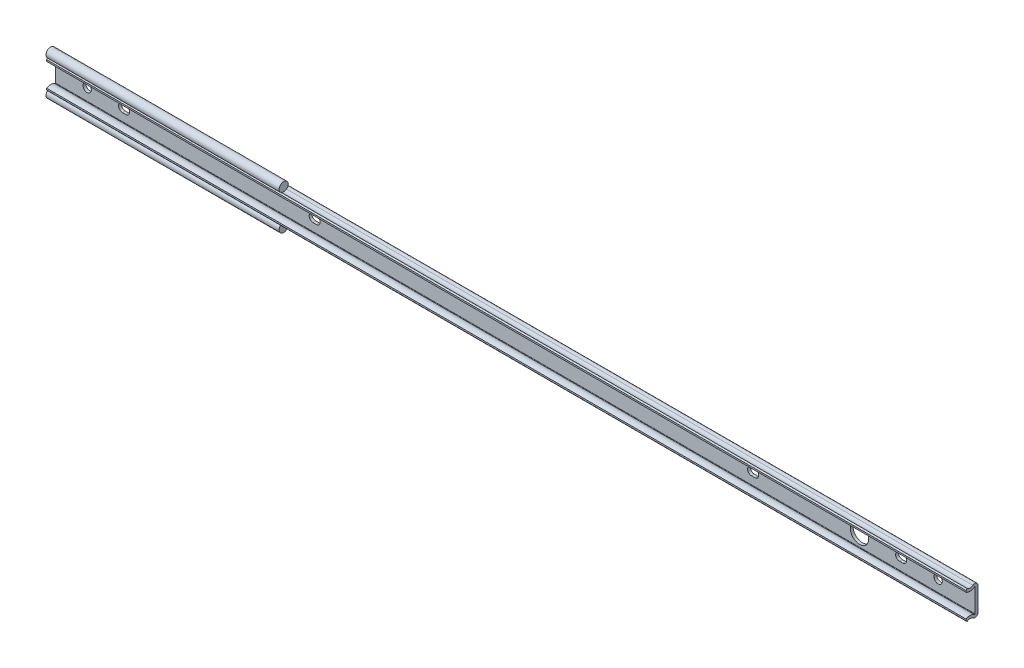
ISO-10303-21;
HEADER;
FILE_DESCRIPTION(('STEP AP214'),'2;1');
FILE_NAME('part.step','',(''),(''),'','','');
FILE_SCHEMA(('AUTOMOTIVE_DESIGN { 1 0 10303 214 1 1 1 1 }'));
ENDSEC;
DATA;
#1=APPLICATION_CONTEXT('core data for automotive mechanical design processes');
#2=APPLICATION_PROTOCOL_DEFINITION('international standard','automotive_design',2000,#1);
#3=PRODUCT_CONTEXT('',#1,'mechanical');
#4=PRODUCT('Part','Part','',(#3));
#5=PRODUCT_RELATED_PRODUCT_CATEGORY('part','',(#4));
#6=PRODUCT_DEFINITION_FORMATION('','',#4);
#7=PRODUCT_DEFINITION_CONTEXT('part definition',#1,'design');
#8=PRODUCT_DEFINITION('design','',#6,#7);
#9=PRODUCT_DEFINITION_SHAPE('','',#8);
#10=(LENGTH_UNIT() NAMED_UNIT(*) SI_UNIT(.MILLI.,.METRE.));
#11=(NAMED_UNIT(*) PLANE_ANGLE_UNIT() SI_UNIT($,.RADIAN.));
#12=(NAMED_UNIT(*) SI_UNIT($,.STERADIAN.) SOLID_ANGLE_UNIT());
#13=UNCERTAINTY_MEASURE_WITH_UNIT(LENGTH_MEASURE(1.E-05),#10,'distance_accuracy_value','');
#14=(GEOMETRIC_REPRESENTATION_CONTEXT(3) GLOBAL_UNCERTAINTY_ASSIGNED_CONTEXT((#13)) GLOBAL_UNIT_ASSIGNED_CONTEXT((#10,
#11,#12)) REPRESENTATION_CONTEXT('',''));
#15=CARTESIAN_POINT('',(0.,0.,0.));
#16=DIRECTION('',(0.,0.,1.));
#17=DIRECTION('',(1.,0.,0.));
#18=AXIS2_PLACEMENT_3D('',#15,#16,#17);
#19=CARTESIAN_POINT('',(-34.3563727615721,9.67006993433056,4.30999988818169));
#20=DIRECTION('',(1.,0.,0.));
#21=DIRECTION('',(0.,0.,-1.));
#22=AXIS2_PLACEMENT_3D('',#19,#20,#21);
#23=CYLINDRICAL_SURFACE('',#22,2.48);
#24=DIRECTION('',(1.,0.,0.));
#25=VECTOR('',#24,1.);
#26=CARTESIAN_POINT('',(-34.3563727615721,7.69580952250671,2.80910154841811));
#27=LINE('',#26,#25);
#28=CARTESIAN_POINT('',(109.,7.6958095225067,2.80910154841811));
#29=VERTEX_POINT('',#28);
#30=CARTESIAN_POINT('',(480.,7.6958095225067,2.80910154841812));
#31=VERTEX_POINT('',#30);
#32=EDGE_CURVE('E418',#29,#31,#27,.T.);
#33=ORIENTED_EDGE('',*,*,#32,.F.);
#34=CARTESIAN_POINT('',(109.,9.67006993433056,4.30999988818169));
#35=DIRECTION('',(-1.,0.,0.));
#36=DIRECTION('',(0.,0.,1.));
#37=AXIS2_PLACEMENT_3D('',#34,#35,#36);
#38=CIRCLE('',#37,2.48);
#39=CARTESIAN_POINT('',(109.,7.77027971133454,5.90411315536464));
#40=VERTEX_POINT('',#39);
#41=EDGE_CURVE('E272',#29,#40,#38,.T.);
#42=ORIENTED_EDGE('',*,*,#41,.T.);
#43=DIRECTION('',(1.,0.,0.));
#44=VECTOR('',#43,1.);
#45=CARTESIAN_POINT('',(-34.3563727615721,7.77027971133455,5.90411315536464));
#46=LINE('',#45,#44);
#47=CARTESIAN_POINT('',(480.,7.77027971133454,5.90411315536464));
#48=VERTEX_POINT('',#47);
#49=EDGE_CURVE('E416',#40,#48,#46,.T.);
#50=ORIENTED_EDGE('',*,*,#49,.T.);
#51=CARTESIAN_POINT('',(480.,9.67006993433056,4.30999988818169));
#52=DIRECTION('',(-1.,0.,0.));
#53=DIRECTION('',(0.,0.,1.));
#54=AXIS2_PLACEMENT_3D('',#51,#52,#53);
#55=CIRCLE('',#54,2.48);
#56=EDGE_CURVE('E391',#31,#48,#55,.T.);
#57=ORIENTED_EDGE('',*,*,#56,.F.);
#58=EDGE_LOOP('',(#33,#42,#50,#57));
#59=FACE_BOUND('',#58,.T.);
#60=ADVANCED_FACE('F14',(#59),#23,.F.);
#61=CARTESIAN_POINT('',(-34.3563727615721,6.30268270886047,1.74999971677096));
#62=DIRECTION('',(1.,0.,0.));
#63=DIRECTION('',(0.,0.,-1.));
#64=AXIS2_PLACEMENT_3D('',#61,#62,#63);
#65=CYLINDRICAL_SURFACE('',#64,0.199999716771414);
#66=CARTESIAN_POINT('',(-17.,6.30268270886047,1.74999971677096));
#67=DIRECTION('',(1.,0.,0.));
#68=DIRECTION('',(0.,0.,-1.));
#69=AXIS2_PLACEMENT_3D('',#66,#67,#68);
#70=CIRCLE('',#69,0.199999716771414);
#71=CARTESIAN_POINT('',(-17.,6.30268270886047,1.54999999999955));
#72=VERTEX_POINT('',#71);
#73=CARTESIAN_POINT('',(-17.,6.46189676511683,1.87104008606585));
#74=VERTEX_POINT('',#73);
#75=EDGE_CURVE('E382',#72,#74,#70,.T.);
#76=ORIENTED_EDGE('',*,*,#75,.F.);
#77=DIRECTION('',(1.,0.,0.));
#78=VECTOR('',#77,1.);
#79=CARTESIAN_POINT('',(-34.3563727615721,6.30268270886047,1.54999999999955));
#80=LINE('',#79,#78);
#81=CARTESIAN_POINT('',(480.,6.30268270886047,1.54999999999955));
#82=VERTEX_POINT('',#81);
#83=EDGE_CURVE('E369',#72,#82,#80,.T.);
#84=ORIENTED_EDGE('',*,*,#83,.T.);
#85=CARTESIAN_POINT('',(480.,6.30268270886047,1.74999971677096));
#86=DIRECTION('',(-1.,0.,0.));
#87=DIRECTION('',(0.,0.,1.));
#88=AXIS2_PLACEMENT_3D('',#85,#86,#87);
#89=CIRCLE('',#88,0.199999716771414);
#90=CARTESIAN_POINT('',(480.,6.46189676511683,1.87104008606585));
#91=VERTEX_POINT('',#90);
#92=EDGE_CURVE('E404',#91,#82,#89,.T.);
#93=ORIENTED_EDGE('',*,*,#92,.F.);
#94=DIRECTION('',(1.,0.,0.));
#95=VECTOR('',#94,1.);
#96=CARTESIAN_POINT('',(-34.3563727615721,6.46189676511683,1.87104008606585));
#97=LINE('',#96,#95);
#98=EDGE_CURVE('E410',#74,#91,#97,.T.);
#99=ORIENTED_EDGE('',*,*,#98,.F.);
#100=EDGE_LOOP('',(#76,#84,#93,#99));
#101=FACE_BOUND('',#100,.T.);
#102=ADVANCED_FACE('F567',(#101),#65,.F.);
#103=CARTESIAN_POINT('',(-34.3563727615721,9.67006993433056,4.30999988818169));
#104=DIRECTION('',(1.,0.,0.));
#105=DIRECTION('',(0.,0.,-1.));
#106=AXIS2_PLACEMENT_3D('',#103,#104,#105);
#107=CYLINDRICAL_SURFACE('',#106,4.03);
#108=CARTESIAN_POINT('',(-17.,9.67006993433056,4.30999988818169));
#109=DIRECTION('',(1.,0.,0.));
#110=DIRECTION('',(0.,0.,-1.));
#111=AXIS2_PLACEMENT_3D('',#108,#109,#110);
#112=CIRCLE('',#111,4.03);
#113=CARTESIAN_POINT('',(-17.,6.26782067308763,6.46999987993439));
#114=VERTEX_POINT('',#113);
#115=EDGE_CURVE('E380',#74,#114,#112,.F.);
#116=ORIENTED_EDGE('',*,*,#115,.F.);
#117=ORIENTED_EDGE('',*,*,#98,.T.);
#118=CARTESIAN_POINT('',(480.,9.67006993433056,4.30999988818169));
#119=DIRECTION('',(1.,0.,0.));
#120=DIRECTION('',(0.,0.,1.));
#121=AXIS2_PLACEMENT_3D('',#118,#119,#120);
#122=CIRCLE('',#121,4.03);
#123=CARTESIAN_POINT('',(480.,6.26782067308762,6.46999987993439));
#124=VERTEX_POINT('',#123);
#125=EDGE_CURVE('E401',#124,#91,#122,.T.);
#126=ORIENTED_EDGE('',*,*,#125,.F.);
#127=DIRECTION('',(1.,0.,0.));
#128=VECTOR('',#127,1.);
#129=CARTESIAN_POINT('',(-34.3563727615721,6.26782067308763,6.46999987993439));
#130=LINE('',#129,#128);
#131=EDGE_CURVE('E412',#114,#124,#130,.T.);
#132=ORIENTED_EDGE('',*,*,#131,.F.);
#133=EDGE_LOOP('',(#116,#117,#126,#132));
#134=FACE_BOUND('',#133,.T.);
#135=ADVANCED_FACE('F574',(#134),#107,.T.);
#136=CARTESIAN_POINT('',(-34.3563727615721,6.26782067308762,6.46999987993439));
#137=DIRECTION('',(0.,0.,1.));
#138=DIRECTION('',(1.,0.,0.));
#139=AXIS2_PLACEMENT_3D('',#136,#137,#138);
#140=PLANE('',#139);
#141=DIRECTION('',(0.,1.,0.));
#142=VECTOR('',#141,1.);
#143=CARTESIAN_POINT('',(-17.,6.26782067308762,6.46999987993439));
#144=LINE('',#143,#142);
#145=CARTESIAN_POINT('',(-17.,7.09588293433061,6.46999987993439));
#146=VERTEX_POINT('',#145);
#147=EDGE_CURVE('E378',#114,#146,#144,.T.);
#148=ORIENTED_EDGE('',*,*,#147,.F.);
#149=ORIENTED_EDGE('',*,*,#131,.T.);
#150=DIRECTION('',(0.,-1.,0.));
#151=VECTOR('',#150,1.);
#152=CARTESIAN_POINT('',(480.,6.26782067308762,6.46999987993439));
#153=LINE('',#152,#151);
#154=CARTESIAN_POINT('',(480.,7.09588293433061,6.46999987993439));
#155=VERTEX_POINT('',#154);
#156=EDGE_CURVE('E398',#155,#124,#153,.T.);
#157=ORIENTED_EDGE('',*,*,#156,.F.);
#158=DIRECTION('',(1.,0.,0.));
#159=VECTOR('',#158,1.);
#160=CARTESIAN_POINT('',(-34.3563727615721,7.09588293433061,6.46999987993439));
#161=LINE('',#160,#159);
#162=EDGE_CURVE('E414',#146,#155,#161,.T.);
#163=ORIENTED_EDGE('',*,*,#162,.F.);
#164=EDGE_LOOP('',(#148,#149,#157,#163));
#165=FACE_BOUND('',#164,.T.);
#166=ADVANCED_FACE('F579',(#165),#140,.T.);
#167=CARTESIAN_POINT('',(-34.3563727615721,7.09588293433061,6.46999987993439));
#168=DIRECTION('',(0.,0.642788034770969,0.766044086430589));
#169=DIRECTION('',(0.,-0.766044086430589,0.642788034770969));
#170=AXIS2_PLACEMENT_3D('',#167,#168,#169);
#171=PLANE('',#170);
#172=DIRECTION('',(-1.,0.,0.));
#173=VECTOR('',#172,1.);
#174=CARTESIAN_POINT('',(109.,7.6554298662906,6.00048372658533));
#175=LINE('',#174,#173);
#176=CARTESIAN_POINT('',(-17.,7.6554298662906,6.00048372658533));
#177=VERTEX_POINT('',#176);
#178=CARTESIAN_POINT('',(109.,7.6554298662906,6.00048372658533));
#179=VERTEX_POINT('',#178);
#180=EDGE_CURVE('E270',#177,#179,#175,.F.);
#181=ORIENTED_EDGE('',*,*,#180,.F.);
#182=DIRECTION('',(0.,0.766044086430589,-0.642788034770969));
#183=VECTOR('',#182,1.);
#184=CARTESIAN_POINT('',(-17.,7.09588293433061,6.46999987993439));
#185=LINE('',#184,#183);
#186=EDGE_CURVE('E376',#146,#177,#185,.T.);
#187=ORIENTED_EDGE('',*,*,#186,.F.);
#188=ORIENTED_EDGE('',*,*,#162,.T.);
#189=DIRECTION('',(0.,-0.766044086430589,0.642788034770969));
#190=VECTOR('',#189,1.);
#191=CARTESIAN_POINT('',(480.,7.09588293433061,6.46999987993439));
#192=LINE('',#191,#190);
#193=EDGE_CURVE('E395',#48,#155,#192,.T.);
#194=ORIENTED_EDGE('',*,*,#193,.F.);
#195=ORIENTED_EDGE('',*,*,#49,.F.);
#196=DIRECTION('',(0.,-0.766044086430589,0.642788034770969));
#197=VECTOR('',#196,1.);
#198=CARTESIAN_POINT('',(109.,7.09588293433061,6.46999987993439));
#199=LINE('',#198,#197);
#200=EDGE_CURVE('E275',#40,#179,#199,.T.);
#201=ORIENTED_EDGE('',*,*,#200,.T.);
#202=EDGE_LOOP('',(#181,#187,#188,#194,#195,#201));
#203=FACE_BOUND('',#202,.T.);
#204=ADVANCED_FACE('F582',(#203),#171,.T.);
#205=CARTESIAN_POINT('',(-34.3563727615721,6.30268270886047,1.74999971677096));
#206=DIRECTION('',(1.,0.,0.));
#207=DIRECTION('',(0.,0.,-1.));
#208=AXIS2_PLACEMENT_3D('',#205,#206,#207);
#209=CYLINDRICAL_SURFACE('',#208,1.74999971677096);
#210=DIRECTION('',(-1.,0.,0.));
#211=VECTOR('',#210,1.);
#212=CARTESIAN_POINT('',(46.,7.94505035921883,2.35425753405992));
#213=LINE('',#212,#211);
#214=CARTESIAN_POINT('',(109.,7.94505035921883,2.35425753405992));
#215=VERTEX_POINT('',#214);
#216=CARTESIAN_POINT('',(-17.,7.94505035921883,2.35425753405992));
#217=VERTEX_POINT('',#216);
#218=EDGE_CURVE('E267',#215,#217,#213,.T.);
#219=ORIENTED_EDGE('',*,*,#218,.F.);
#220=CARTESIAN_POINT('',(109.,6.30268270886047,1.74999971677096));
#221=DIRECTION('',(-1.,0.,0.));
#222=DIRECTION('',(0.,0.,1.));
#223=AXIS2_PLACEMENT_3D('',#220,#221,#222);
#224=CIRCLE('',#223,1.74999971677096);
#225=EDGE_CURVE('E22',#215,#29,#224,.F.);
#226=ORIENTED_EDGE('',*,*,#225,.T.);
#227=ORIENTED_EDGE('',*,*,#32,.T.);
#228=CARTESIAN_POINT('',(480.,6.30268270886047,1.74999971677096));
#229=DIRECTION('',(1.,0.,0.));
#230=DIRECTION('',(0.,0.,1.));
#231=AXIS2_PLACEMENT_3D('',#228,#229,#230);
#232=CIRCLE('',#231,1.74999971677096);
#233=CARTESIAN_POINT('',(480.,6.30268270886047,0.));
#234=VERTEX_POINT('',#233);
#235=EDGE_CURVE('E388',#234,#31,#232,.T.);
#236=ORIENTED_EDGE('',*,*,#235,.F.);
#237=DIRECTION('',(1.,0.,0.));
#238=VECTOR('',#237,1.);
#239=CARTESIAN_POINT('',(-34.3563727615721,6.30268270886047,0.));
#240=LINE('',#239,#238);
#241=CARTESIAN_POINT('',(-17.,6.30268270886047,0.));
#242=VERTEX_POINT('',#241);
#243=EDGE_CURVE('E407',#242,#234,#240,.T.);
#244=ORIENTED_EDGE('',*,*,#243,.F.);
#245=CARTESIAN_POINT('',(-17.,6.30268270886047,1.74999971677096));
#246=DIRECTION('',(1.,0.,0.));
#247=DIRECTION('',(0.,0.,-1.));
#248=AXIS2_PLACEMENT_3D('',#245,#246,#247);
#249=CIRCLE('',#248,1.74999971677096);
#250=EDGE_CURVE('E374',#217,#242,#249,.F.);
#251=ORIENTED_EDGE('',*,*,#250,.F.);
#252=EDGE_LOOP('',(#219,#226,#227,#236,#244,#251));
#253=FACE_BOUND('',#252,.T.);
#254=ADVANCED_FACE('F520',(#253),#209,.T.);
#255=CARTESIAN_POINT('',(480.,-6.30268270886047,1.74999971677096));
#256=DIRECTION('',(-1.,0.,0.));
#257=DIRECTION('',(0.,0.,1.));
#258=AXIS2_PLACEMENT_3D('',#255,#256,#257);
#259=CYLINDRICAL_SURFACE('',#258,1.74999971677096);
#260=CARTESIAN_POINT('',(109.,-6.30268270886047,1.74999971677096));
#261=DIRECTION('',(1.,0.,0.));
#262=DIRECTION('',(0.,0.,-1.));
#263=AXIS2_PLACEMENT_3D('',#260,#261,#262);
#264=CIRCLE('',#263,1.74999971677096);
#265=CARTESIAN_POINT('',(109.,-7.6958095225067,2.80910154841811));
#266=VERTEX_POINT('',#265);
#267=CARTESIAN_POINT('',(109.,-7.94505035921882,2.35425753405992));
#268=VERTEX_POINT('',#267);
#269=EDGE_CURVE('E245',#266,#268,#264,.T.);
#270=ORIENTED_EDGE('',*,*,#269,.T.);
#271=DIRECTION('',(-1.,0.,0.));
#272=VECTOR('',#271,1.);
#273=CARTESIAN_POINT('',(46.,-7.94505035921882,2.35425753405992));
#274=LINE('',#273,#272);
#275=CARTESIAN_POINT('',(-17.,-7.94505035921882,2.35425753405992));
#276=VERTEX_POINT('',#275);
#277=EDGE_CURVE('E246',#268,#276,#274,.T.);
#278=ORIENTED_EDGE('',*,*,#277,.T.);
#279=CARTESIAN_POINT('',(-17.,-6.30268270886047,1.74999971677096));
#280=DIRECTION('',(1.,0.,0.));
#281=DIRECTION('',(0.,0.,-1.));
#282=AXIS2_PLACEMENT_3D('',#279,#280,#281);
#283=CIRCLE('',#282,1.74999971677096);
#284=CARTESIAN_POINT('',(-17.,-6.30268270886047,0.));
#285=VERTEX_POINT('',#284);
#286=EDGE_CURVE('E371',#285,#276,#283,.F.);
#287=ORIENTED_EDGE('',*,*,#286,.F.);
#288=DIRECTION('',(-1.,0.,0.));
#289=VECTOR('',#288,1.);
#290=CARTESIAN_POINT('',(480.,-6.30268270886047,0.));
#291=LINE('',#290,#289);
#292=CARTESIAN_POINT('',(480.,-6.30268270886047,0.));
#293=VERTEX_POINT('',#292);
#294=EDGE_CURVE('E459',#293,#285,#291,.T.);
#295=ORIENTED_EDGE('',*,*,#294,.F.);
#296=CARTESIAN_POINT('',(480.,-6.30268270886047,1.74999971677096));
#297=DIRECTION('',(1.,0.,0.));
#298=DIRECTION('',(0.,0.,-1.));
#299=AXIS2_PLACEMENT_3D('',#296,#297,#298);
#300=CIRCLE('',#299,1.74999971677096);
#301=CARTESIAN_POINT('',(480.,-7.6958095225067,2.80910154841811));
#302=VERTEX_POINT('',#301);
#303=EDGE_CURVE('E429',#302,#293,#300,.T.);
#304=ORIENTED_EDGE('',*,*,#303,.F.);
#305=DIRECTION('',(-1.,0.,0.));
#306=VECTOR('',#305,1.);
#307=CARTESIAN_POINT('',(480.,-7.6958095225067,2.80910154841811));
#308=LINE('',#307,#306);
#309=EDGE_CURVE('E445',#302,#266,#308,.T.);
#310=ORIENTED_EDGE('',*,*,#309,.T.);
#311=EDGE_LOOP('',(#270,#278,#287,#295,#304,#310));
#312=FACE_BOUND('',#311,.T.);
#313=ADVANCED_FACE('F16',(#312),#259,.T.);
#314=CARTESIAN_POINT('',(480.,-6.30268270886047,0.));
#315=DIRECTION('',(0.,0.,1.));
#316=DIRECTION('',(0.,-1.,0.));
#317=AXIS2_PLACEMENT_3D('',#314,#315,#316);
#318=PLANE('',#317);
#319=CARTESIAN_POINT('',(460.,0.,0.));
#320=DIRECTION('',(0.,0.,-1.));
#321=DIRECTION('',(0.,1.,0.));
#322=AXIS2_PLACEMENT_3D('',#319,#320,#321);
#323=CIRCLE('',#322,2.24999999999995);
#324=CARTESIAN_POINT('',(460.,2.2499999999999,0.));
#325=VERTEX_POINT('',#324);
#326=EDGE_CURVE('E278',#325,#325,#323,.T.);
#327=ORIENTED_EDGE('',*,*,#326,.F.);
#328=EDGE_LOOP('',(#327));
#329=FACE_BOUND('',#328,.T.);
#330=DIRECTION('',(-1.,0.,0.));
#331=VECTOR('',#330,1.);
#332=CARTESIAN_POINT('',(20.9,-2.09999999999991,0.));
#333=LINE('',#332,#331);
#334=CARTESIAN_POINT('',(20.9,-2.09999999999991,0.));
#335=VERTEX_POINT('',#334);
#336=CARTESIAN_POINT('',(19.1,-2.09999999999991,0.));
#337=VERTEX_POINT('',#336);
#338=EDGE_CURVE('E306',#335,#337,#333,.T.);
#339=ORIENTED_EDGE('',*,*,#338,.F.);
#340=CARTESIAN_POINT('',(20.9,0.,0.));
#341=DIRECTION('',(0.,0.,-1.));
#342=DIRECTION('',(0.,1.,0.));
#343=AXIS2_PLACEMENT_3D('',#340,#341,#342);
#344=CIRCLE('',#343,2.1);
#345=CARTESIAN_POINT('',(20.9,2.10000000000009,0.));
#346=VERTEX_POINT('',#345);
#347=EDGE_CURVE('E37',#346,#335,#344,.T.);
#348=ORIENTED_EDGE('',*,*,#347,.F.);
#349=DIRECTION('',(1.,0.,0.));
#350=VECTOR('',#349,1.);
#351=CARTESIAN_POINT('',(20.9,2.10000000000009,0.));
#352=LINE('',#351,#350);
#353=CARTESIAN_POINT('',(19.1,2.10000000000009,0.));
#354=VERTEX_POINT('',#353);
#355=EDGE_CURVE('E312',#354,#346,#352,.T.);
#356=ORIENTED_EDGE('',*,*,#355,.F.);
#357=CARTESIAN_POINT('',(19.1,0.,0.));
#358=DIRECTION('',(0.,0.,-1.));
#359=DIRECTION('',(0.,1.,0.));
#360=AXIS2_PLACEMENT_3D('',#357,#358,#359);
#361=CIRCLE('',#360,2.1);
#362=EDGE_CURVE('E309',#337,#354,#361,.T.);
#363=ORIENTED_EDGE('',*,*,#362,.F.);
#364=EDGE_LOOP('',(#339,#348,#356,#363));
#365=FACE_BOUND('',#364,.T.);
#366=DIRECTION('',(-1.,0.,0.));
#367=VECTOR('',#366,1.);
#368=CARTESIAN_POINT('',(123.9,-2.09999999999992,0.));
#369=LINE('',#368,#367);
#370=CARTESIAN_POINT('',(123.9,-2.09999999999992,0.));
#371=VERTEX_POINT('',#370);
#372=CARTESIAN_POINT('',(122.1,-2.09999999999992,0.));
#373=VERTEX_POINT('',#372);
#374=EDGE_CURVE('E285',#371,#373,#369,.T.);
#375=ORIENTED_EDGE('',*,*,#374,.F.);
#376=CARTESIAN_POINT('',(123.9,0.,0.));
#377=DIRECTION('',(0.,0.,-1.));
#378=DIRECTION('',(0.,1.,0.));
#379=AXIS2_PLACEMENT_3D('',#376,#377,#378);
#380=CIRCLE('',#379,2.1);
#381=CARTESIAN_POINT('',(123.9,2.10000000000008,0.));
#382=VERTEX_POINT('',#381);
#383=EDGE_CURVE('E283',#382,#371,#380,.T.);
#384=ORIENTED_EDGE('',*,*,#383,.F.);
#385=DIRECTION('',(1.,0.,0.));
#386=VECTOR('',#385,1.);
#387=CARTESIAN_POINT('',(123.9,2.10000000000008,0.));
#388=LINE('',#387,#386);
#389=CARTESIAN_POINT('',(122.1,2.10000000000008,0.));
#390=VERTEX_POINT('',#389);
#391=EDGE_CURVE('E292',#390,#382,#388,.T.);
#392=ORIENTED_EDGE('',*,*,#391,.F.);
#393=CARTESIAN_POINT('',(122.1,0.,0.));
#394=DIRECTION('',(0.,0.,-1.));
#395=DIRECTION('',(0.,1.,0.));
#396=AXIS2_PLACEMENT_3D('',#393,#394,#395);
#397=CIRCLE('',#396,2.1);
#398=EDGE_CURVE('E289',#373,#390,#397,.T.);
#399=ORIENTED_EDGE('',*,*,#398,.F.);
#400=EDGE_LOOP('',(#375,#384,#392,#399));
#401=FACE_BOUND('',#400,.T.);
#402=CARTESIAN_POINT('',(0.,0.,0.));
#403=DIRECTION('',(0.,0.,-1.));
#404=DIRECTION('',(0.,1.,0.));
#405=AXIS2_PLACEMENT_3D('',#402,#403,#404);
#406=CIRCLE('',#405,2.24999999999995);
#407=CARTESIAN_POINT('',(0.,2.24999999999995,0.));
#408=VERTEX_POINT('',#407);
#409=EDGE_CURVE('E282',#408,#408,#406,.T.);
#410=ORIENTED_EDGE('',*,*,#409,.F.);
#411=EDGE_LOOP('',(#410));
#412=FACE_BOUND('',#411,.T.);
#413=CARTESIAN_POINT('',(417.5,0.,0.));
#414=DIRECTION('',(0.,0.,-1.));
#415=DIRECTION('',(0.,1.,0.));
#416=AXIS2_PLACEMENT_3D('',#413,#414,#415);
#417=CIRCLE('',#416,5.);
#418=CARTESIAN_POINT('',(417.5,4.99999999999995,0.));
#419=VERTEX_POINT('',#418);
#420=EDGE_CURVE('E337',#419,#419,#417,.T.);
#421=ORIENTED_EDGE('',*,*,#420,.F.);
#422=EDGE_LOOP('',(#421));
#423=FACE_BOUND('',#422,.T.);
#424=DIRECTION('',(-1.,0.,0.));
#425=VECTOR('',#424,1.);
#426=CARTESIAN_POINT('',(440.9,-2.10000000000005,0.));
#427=LINE('',#426,#425);
#428=CARTESIAN_POINT('',(440.9,-2.10000000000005,0.));
#429=VERTEX_POINT('',#428);
#430=CARTESIAN_POINT('',(439.1,-2.10000000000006,0.));
#431=VERTEX_POINT('',#430);
#432=EDGE_CURVE('E324',#429,#431,#427,.T.);
#433=ORIENTED_EDGE('',*,*,#432,.F.);
#434=CARTESIAN_POINT('',(440.9,0.,0.));
#435=DIRECTION('',(0.,0.,-1.));
#436=DIRECTION('',(0.,1.,0.));
#437=AXIS2_PLACEMENT_3D('',#434,#435,#436);
#438=CIRCLE('',#437,2.1);
#439=CARTESIAN_POINT('',(440.9,2.09999999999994,0.));
#440=VERTEX_POINT('',#439);
#441=EDGE_CURVE('E322',#440,#429,#438,.T.);
#442=ORIENTED_EDGE('',*,*,#441,.F.);
#443=DIRECTION('',(1.,0.,0.));
#444=VECTOR('',#443,1.);
#445=CARTESIAN_POINT('',(440.9,2.09999999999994,0.));
#446=LINE('',#445,#444);
#447=CARTESIAN_POINT('',(439.1,2.09999999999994,0.));
#448=VERTEX_POINT('',#447);
#449=EDGE_CURVE('E331',#448,#440,#446,.T.);
#450=ORIENTED_EDGE('',*,*,#449,.F.);
#451=CARTESIAN_POINT('',(439.1,0.,0.));
#452=DIRECTION('',(0.,0.,-1.));
#453=DIRECTION('',(0.,1.,0.));
#454=AXIS2_PLACEMENT_3D('',#451,#452,#453);
#455=CIRCLE('',#454,2.1);
#456=EDGE_CURVE('E328',#431,#448,#455,.T.);
#457=ORIENTED_EDGE('',*,*,#456,.F.);
#458=EDGE_LOOP('',(#433,#442,#450,#457));
#459=FACE_BOUND('',#458,.T.);
#460=DIRECTION('',(-1.,0.,0.));
#461=VECTOR('',#460,1.);
#462=CARTESIAN_POINT('',(360.9,-2.1,0.));
#463=LINE('',#462,#461);
#464=CARTESIAN_POINT('',(360.9,-2.1,0.));
#465=VERTEX_POINT('',#464);
#466=CARTESIAN_POINT('',(359.1,-2.1,0.));
#467=VERTEX_POINT('',#466);
#468=EDGE_CURVE('E345',#465,#467,#463,.T.);
#469=ORIENTED_EDGE('',*,*,#468,.F.);
#470=CARTESIAN_POINT('',(360.9,0.,0.));
#471=DIRECTION('',(0.,0.,-1.));
#472=DIRECTION('',(0.,1.,0.));
#473=AXIS2_PLACEMENT_3D('',#470,#471,#472);
#474=CIRCLE('',#473,2.1);
#475=CARTESIAN_POINT('',(360.9,2.1,0.));
#476=VERTEX_POINT('',#475);
#477=EDGE_CURVE('E298',#476,#465,#474,.T.);
#478=ORIENTED_EDGE('',*,*,#477,.F.);
#479=DIRECTION('',(1.,0.,0.));
#480=VECTOR('',#479,1.);
#481=CARTESIAN_POINT('',(360.9,2.1,0.));
#482=LINE('',#481,#480);
#483=CARTESIAN_POINT('',(359.1,2.1,0.));
#484=VERTEX_POINT('',#483);
#485=EDGE_CURVE('E351',#484,#476,#482,.T.);
#486=ORIENTED_EDGE('',*,*,#485,.F.);
#487=CARTESIAN_POINT('',(359.1,0.,0.));
#488=DIRECTION('',(0.,0.,-1.));
#489=DIRECTION('',(0.,1.,0.));
#490=AXIS2_PLACEMENT_3D('',#487,#488,#489);
#491=CIRCLE('',#490,2.1);
#492=EDGE_CURVE('E348',#467,#484,#491,.T.);
#493=ORIENTED_EDGE('',*,*,#492,.F.);
#494=EDGE_LOOP('',(#469,#478,#486,#493));
#495=FACE_BOUND('',#494,.T.);
#496=ORIENTED_EDGE('',*,*,#294,.T.);
#497=DIRECTION('',(0.,1.,0.));
#498=VECTOR('',#497,1.);
#499=CARTESIAN_POINT('',(-17.,-6.30268270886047,0.));
#500=LINE('',#499,#498);
#501=EDGE_CURVE('E424',#285,#242,#500,.T.);
#502=ORIENTED_EDGE('',*,*,#501,.T.);
#503=ORIENTED_EDGE('',*,*,#243,.T.);
#504=DIRECTION('',(0.,1.,0.));
#505=VECTOR('',#504,1.);
#506=CARTESIAN_POINT('',(480.,-6.30268270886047,0.));
#507=LINE('',#506,#505);
#508=EDGE_CURVE('E431',#293,#234,#507,.T.);
#509=ORIENTED_EDGE('',*,*,#508,.F.);
#510=EDGE_LOOP('',(#496,#502,#503,#509));
#511=FACE_BOUND('',#510,.T.);
#512=ADVANCED_FACE('F534',(#329,#365,#401,#412,#423,#459,#495,#511),#318,.F.);
#513=CARTESIAN_POINT('',(480.,-6.30268270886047,1.54999999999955));
#514=DIRECTION('',(0.,0.,-1.));
#515=DIRECTION('',(-1.,0.,0.));
#516=AXIS2_PLACEMENT_3D('',#513,#514,#515);
#517=PLANE('',#516);
#518=CARTESIAN_POINT('',(460.,0.,1.54999999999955));
#519=DIRECTION('',(0.,0.,-1.));
#520=DIRECTION('',(-1.,0.,0.));
#521=AXIS2_PLACEMENT_3D('',#518,#519,#520);
#522=CIRCLE('',#521,2.24999999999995);
#523=CARTESIAN_POINT('',(457.75,0.,1.54999999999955));
#524=VERTEX_POINT('',#523);
#525=EDGE_CURVE('E392',#524,#524,#522,.T.);
#526=ORIENTED_EDGE('',*,*,#525,.T.);
#527=EDGE_LOOP('',(#526));
#528=FACE_BOUND('',#527,.T.);
#529=DIRECTION('',(1.,0.,0.));
#530=VECTOR('',#529,1.);
#531=CARTESIAN_POINT('',(480.,2.1,1.54999999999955));
#532=LINE('',#531,#530);
#533=CARTESIAN_POINT('',(19.1,2.10000000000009,1.54999999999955));
#534=VERTEX_POINT('',#533);
#535=CARTESIAN_POINT('',(20.9,2.10000000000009,1.54999999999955));
#536=VERTEX_POINT('',#535);
#537=EDGE_CURVE('E509',#534,#536,#532,.T.);
#538=ORIENTED_EDGE('',*,*,#537,.T.);
#539=CARTESIAN_POINT('',(20.9,0.,1.54999999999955));
#540=DIRECTION('',(0.,0.,-1.));
#541=DIRECTION('',(-1.,0.,0.));
#542=AXIS2_PLACEMENT_3D('',#539,#540,#541);
#543=CIRCLE('',#542,2.1);
#544=CARTESIAN_POINT('',(20.9,-2.09999999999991,1.54999999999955));
#545=VERTEX_POINT('',#544);
#546=EDGE_CURVE('E512',#536,#545,#543,.T.);
#547=ORIENTED_EDGE('',*,*,#546,.T.);
#548=DIRECTION('',(-1.,0.,0.));
#549=VECTOR('',#548,1.);
#550=CARTESIAN_POINT('',(480.,-2.1,1.54999999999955));
#551=LINE('',#550,#549);
#552=CARTESIAN_POINT('',(19.1,-2.09999999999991,1.54999999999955));
#553=VERTEX_POINT('',#552);
#554=EDGE_CURVE('E503',#545,#553,#551,.T.);
#555=ORIENTED_EDGE('',*,*,#554,.T.);
#556=CARTESIAN_POINT('',(19.1,0.,1.54999999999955));
#557=DIRECTION('',(0.,0.,-1.));
#558=DIRECTION('',(-1.,0.,0.));
#559=AXIS2_PLACEMENT_3D('',#556,#557,#558);
#560=CIRCLE('',#559,2.1);
#561=EDGE_CURVE('E506',#553,#534,#560,.T.);
#562=ORIENTED_EDGE('',*,*,#561,.T.);
#563=EDGE_LOOP('',(#538,#547,#555,#562));
#564=FACE_BOUND('',#563,.T.);
#565=DIRECTION('',(1.,0.,0.));
#566=VECTOR('',#565,1.);
#567=CARTESIAN_POINT('',(480.,2.1,1.54999999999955));
#568=LINE('',#567,#566);
#569=CARTESIAN_POINT('',(122.1,2.10000000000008,1.54999999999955));
#570=VERTEX_POINT('',#569);
#571=CARTESIAN_POINT('',(123.9,2.10000000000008,1.54999999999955));
#572=VERTEX_POINT('',#571);
#573=EDGE_CURVE('E497',#570,#572,#568,.T.);
#574=ORIENTED_EDGE('',*,*,#573,.T.);
#575=CARTESIAN_POINT('',(123.9,0.,1.54999999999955));
#576=DIRECTION('',(0.,0.,-1.));
#577=DIRECTION('',(-1.,0.,0.));
#578=AXIS2_PLACEMENT_3D('',#575,#576,#577);
#579=CIRCLE('',#578,2.1);
#580=CARTESIAN_POINT('',(123.9,-2.09999999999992,1.54999999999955));
#581=VERTEX_POINT('',#580);
#582=EDGE_CURVE('E500',#572,#581,#579,.T.);
#583=ORIENTED_EDGE('',*,*,#582,.T.);
#584=DIRECTION('',(-1.,0.,0.));
#585=VECTOR('',#584,1.);
#586=CARTESIAN_POINT('',(480.,-2.1,1.54999999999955));
#587=LINE('',#586,#585);
#588=CARTESIAN_POINT('',(122.1,-2.09999999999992,1.54999999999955));
#589=VERTEX_POINT('',#588);
#590=EDGE_CURVE('E486',#581,#589,#587,.T.);
#591=ORIENTED_EDGE('',*,*,#590,.T.);
#592=CARTESIAN_POINT('',(122.1,0.,1.54999999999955));
#593=DIRECTION('',(0.,0.,-1.));
#594=DIRECTION('',(-1.,0.,0.));
#595=AXIS2_PLACEMENT_3D('',#592,#593,#594);
#596=CIRCLE('',#595,2.1);
#597=EDGE_CURVE('E494',#589,#570,#596,.T.);
#598=ORIENTED_EDGE('',*,*,#597,.T.);
#599=EDGE_LOOP('',(#574,#583,#591,#598));
#600=FACE_BOUND('',#599,.T.);
#601=CARTESIAN_POINT('',(0.,0.,1.54999999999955));
#602=DIRECTION('',(0.,0.,-1.));
#603=DIRECTION('',(-1.,0.,0.));
#604=AXIS2_PLACEMENT_3D('',#601,#602,#603);
#605=CIRCLE('',#604,2.24999999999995);
#606=CARTESIAN_POINT('',(-2.24999999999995,0.,1.54999999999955));
#607=VERTEX_POINT('',#606);
#608=EDGE_CURVE('E489',#607,#607,#605,.T.);
#609=ORIENTED_EDGE('',*,*,#608,.T.);
#610=EDGE_LOOP('',(#609));
#611=FACE_BOUND('',#610,.T.);
#612=CARTESIAN_POINT('',(417.5,0.,1.54999999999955));
#613=DIRECTION('',(0.,0.,-1.));
#614=DIRECTION('',(-1.,0.,0.));
#615=AXIS2_PLACEMENT_3D('',#612,#613,#614);
#616=CIRCLE('',#615,5.);
#617=CARTESIAN_POINT('',(412.5,0.,1.54999999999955));
#618=VERTEX_POINT('',#617);
#619=EDGE_CURVE('E281',#618,#618,#616,.T.);
#620=ORIENTED_EDGE('',*,*,#619,.T.);
#621=EDGE_LOOP('',(#620));
#622=FACE_BOUND('',#621,.T.);
#623=DIRECTION('',(1.,0.,0.));
#624=VECTOR('',#623,1.);
#625=CARTESIAN_POINT('',(480.,2.09999999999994,1.54999999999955));
#626=LINE('',#625,#624);
#627=CARTESIAN_POINT('',(439.1,2.09999999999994,1.54999999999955));
#628=VERTEX_POINT('',#627);
#629=CARTESIAN_POINT('',(440.9,2.09999999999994,1.54999999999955));
#630=VERTEX_POINT('',#629);
#631=EDGE_CURVE('E480',#628,#630,#626,.T.);
#632=ORIENTED_EDGE('',*,*,#631,.T.);
#633=CARTESIAN_POINT('',(440.9,0.,1.54999999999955));
#634=DIRECTION('',(0.,0.,-1.));
#635=DIRECTION('',(-1.,0.,0.));
#636=AXIS2_PLACEMENT_3D('',#633,#634,#635);
#637=CIRCLE('',#636,2.1);
#638=CARTESIAN_POINT('',(440.9,-2.10000000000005,1.54999999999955));
#639=VERTEX_POINT('',#638);
#640=EDGE_CURVE('E483',#630,#639,#637,.T.);
#641=ORIENTED_EDGE('',*,*,#640,.T.);
#642=DIRECTION('',(-1.,0.,0.));
#643=VECTOR('',#642,1.);
#644=CARTESIAN_POINT('',(480.,-2.10000000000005,1.54999999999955));
#645=LINE('',#644,#643);
#646=CARTESIAN_POINT('',(439.1,-2.10000000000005,1.54999999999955));
#647=VERTEX_POINT('',#646);
#648=EDGE_CURVE('E474',#639,#647,#645,.T.);
#649=ORIENTED_EDGE('',*,*,#648,.T.);
#650=CARTESIAN_POINT('',(439.1,0.,1.54999999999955));
#651=DIRECTION('',(0.,0.,-1.));
#652=DIRECTION('',(-1.,0.,0.));
#653=AXIS2_PLACEMENT_3D('',#650,#651,#652);
#654=CIRCLE('',#653,2.1);
#655=EDGE_CURVE('E477',#647,#628,#654,.T.);
#656=ORIENTED_EDGE('',*,*,#655,.T.);
#657=EDGE_LOOP('',(#632,#641,#649,#656));
#658=FACE_BOUND('',#657,.T.);
#659=DIRECTION('',(1.,0.,0.));
#660=VECTOR('',#659,1.);
#661=CARTESIAN_POINT('',(480.,2.09999999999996,1.54999999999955));
#662=LINE('',#661,#660);
#663=CARTESIAN_POINT('',(359.1,2.1,1.54999999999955));
#664=VERTEX_POINT('',#663);
#665=CARTESIAN_POINT('',(360.9,2.1,1.54999999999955));
#666=VERTEX_POINT('',#665);
#667=EDGE_CURVE('E468',#664,#666,#662,.T.);
#668=ORIENTED_EDGE('',*,*,#667,.T.);
#669=CARTESIAN_POINT('',(360.9,0.,1.54999999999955));
#670=DIRECTION('',(0.,0.,-1.));
#671=DIRECTION('',(-1.,0.,0.));
#672=AXIS2_PLACEMENT_3D('',#669,#670,#671);
#673=CIRCLE('',#672,2.1);
#674=CARTESIAN_POINT('',(360.9,-2.1,1.54999999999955));
#675=VERTEX_POINT('',#674);
#676=EDGE_CURVE('E471',#666,#675,#673,.T.);
#677=ORIENTED_EDGE('',*,*,#676,.T.);
#678=DIRECTION('',(-1.,0.,0.));
#679=VECTOR('',#678,1.);
#680=CARTESIAN_POINT('',(480.,-2.10000000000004,1.54999999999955));
#681=LINE('',#680,#679);
#682=CARTESIAN_POINT('',(359.1,-2.1,1.54999999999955));
#683=VERTEX_POINT('',#682);
#684=EDGE_CURVE('E462',#675,#683,#681,.T.);
#685=ORIENTED_EDGE('',*,*,#684,.T.);
#686=CARTESIAN_POINT('',(359.1,0.,1.54999999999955));
#687=DIRECTION('',(0.,0.,-1.));
#688=DIRECTION('',(-1.,0.,0.));
#689=AXIS2_PLACEMENT_3D('',#686,#687,#688);
#690=CIRCLE('',#689,2.1);
#691=EDGE_CURVE('E465',#683,#664,#690,.T.);
#692=ORIENTED_EDGE('',*,*,#691,.T.);
#693=EDGE_LOOP('',(#668,#677,#685,#692));
#694=FACE_BOUND('',#693,.T.);
#695=DIRECTION('',(0.,-1.,0.));
#696=VECTOR('',#695,1.);
#697=CARTESIAN_POINT('',(-17.,-6.30268270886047,1.54999999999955));
#698=LINE('',#697,#696);
#699=CARTESIAN_POINT('',(-17.,-6.30268270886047,1.54999999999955));
#700=VERTEX_POINT('',#699);
#701=EDGE_CURVE('E427',#72,#700,#698,.T.);
#702=ORIENTED_EDGE('',*,*,#701,.T.);
#703=DIRECTION('',(-1.,0.,0.));
#704=VECTOR('',#703,1.);
#705=CARTESIAN_POINT('',(480.,-6.30268270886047,1.54999999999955));
#706=LINE('',#705,#704);
#707=CARTESIAN_POINT('',(480.,-6.30268270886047,1.54999999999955));
#708=VERTEX_POINT('',#707);
#709=EDGE_CURVE('E456',#708,#700,#706,.T.);
#710=ORIENTED_EDGE('',*,*,#709,.F.);
#711=DIRECTION('',(0.,-1.,0.));
#712=VECTOR('',#711,1.);
#713=CARTESIAN_POINT('',(480.,-6.30268270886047,1.54999999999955));
#714=LINE('',#713,#712);
#715=EDGE_CURVE('E433',#82,#708,#714,.T.);
#716=ORIENTED_EDGE('',*,*,#715,.F.);
#717=ORIENTED_EDGE('',*,*,#83,.F.);
#718=EDGE_LOOP('',(#702,#710,#716,#717));
#719=FACE_BOUND('',#718,.T.);
#720=ADVANCED_FACE('F569',(#528,#564,#600,#611,#622,#658,#694,#719),#517,.F.);
#721=CARTESIAN_POINT('',(480.,-6.30268270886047,1.74999971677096));
#722=DIRECTION('',(-1.,0.,0.));
#723=DIRECTION('',(0.,0.,1.));
#724=AXIS2_PLACEMENT_3D('',#721,#722,#723);
#725=CYLINDRICAL_SURFACE('',#724,0.199999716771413);
#726=ORIENTED_EDGE('',*,*,#709,.T.);
#727=CARTESIAN_POINT('',(-17.,-6.30268270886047,1.74999971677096));
#728=DIRECTION('',(1.,0.,0.));
#729=DIRECTION('',(0.,0.,-1.));
#730=AXIS2_PLACEMENT_3D('',#727,#728,#729);
#731=CIRCLE('',#730,0.199999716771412);
#732=CARTESIAN_POINT('',(-17.,-6.46189676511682,1.87104008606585));
#733=VERTEX_POINT('',#732);
#734=EDGE_CURVE('E384',#733,#700,#731,.T.);
#735=ORIENTED_EDGE('',*,*,#734,.F.);
#736=DIRECTION('',(-1.,0.,0.));
#737=VECTOR('',#736,1.);
#738=CARTESIAN_POINT('',(480.,-6.46189676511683,1.87104008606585));
#739=LINE('',#738,#737);
#740=CARTESIAN_POINT('',(480.,-6.46189676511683,1.87104008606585));
#741=VERTEX_POINT('',#740);
#742=EDGE_CURVE('E454',#741,#733,#739,.T.);
#743=ORIENTED_EDGE('',*,*,#742,.F.);
#744=CARTESIAN_POINT('',(480.,-6.30268270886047,1.74999971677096));
#745=DIRECTION('',(-1.,0.,0.));
#746=DIRECTION('',(0.,0.,-1.));
#747=AXIS2_PLACEMENT_3D('',#744,#745,#746);
#748=CIRCLE('',#747,0.199999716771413);
#749=EDGE_CURVE('E435',#708,#741,#748,.T.);
#750=ORIENTED_EDGE('',*,*,#749,.F.);
#751=EDGE_LOOP('',(#726,#735,#743,#750));
#752=FACE_BOUND('',#751,.T.);
#753=ADVANCED_FACE('F559',(#752),#725,.F.);
#754=CARTESIAN_POINT('',(480.,-9.67006993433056,4.30999988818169));
#755=DIRECTION('',(-1.,0.,0.));
#756=DIRECTION('',(0.,0.,1.));
#757=AXIS2_PLACEMENT_3D('',#754,#755,#756);
#758=CYLINDRICAL_SURFACE('',#757,4.03);
#759=ORIENTED_EDGE('',*,*,#742,.T.);
#760=CARTESIAN_POINT('',(-17.,-9.67006993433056,4.30999988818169));
#761=DIRECTION('',(1.,0.,0.));
#762=DIRECTION('',(0.,0.,-1.));
#763=AXIS2_PLACEMENT_3D('',#760,#761,#762);
#764=CIRCLE('',#763,4.03);
#765=CARTESIAN_POINT('',(-17.,-6.26782067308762,6.46999987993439));
#766=VERTEX_POINT('',#765);
#767=EDGE_CURVE('E387',#766,#733,#764,.F.);
#768=ORIENTED_EDGE('',*,*,#767,.F.);
#769=DIRECTION('',(-1.,0.,0.));
#770=VECTOR('',#769,1.);
#771=CARTESIAN_POINT('',(480.,-6.26782067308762,6.46999987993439));
#772=LINE('',#771,#770);
#773=CARTESIAN_POINT('',(480.,-6.26782067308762,6.46999987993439));
#774=VERTEX_POINT('',#773);
#775=EDGE_CURVE('E452',#774,#766,#772,.T.);
#776=ORIENTED_EDGE('',*,*,#775,.F.);
#777=CARTESIAN_POINT('',(480.,-9.67006993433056,4.30999988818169));
#778=DIRECTION('',(1.,0.,0.));
#779=DIRECTION('',(0.,0.,-1.));
#780=AXIS2_PLACEMENT_3D('',#777,#778,#779);
#781=CIRCLE('',#780,4.03);
#782=EDGE_CURVE('E437',#741,#774,#781,.T.);
#783=ORIENTED_EDGE('',*,*,#782,.F.);
#784=EDGE_LOOP('',(#759,#768,#776,#783));
#785=FACE_BOUND('',#784,.T.);
#786=ADVANCED_FACE('F555',(#785),#758,.T.);
#787=CARTESIAN_POINT('',(480.,-6.26782067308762,6.46999987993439));
#788=DIRECTION('',(0.,0.,-1.));
#789=DIRECTION('',(-1.,0.,0.));
#790=AXIS2_PLACEMENT_3D('',#787,#788,#789);
#791=PLANE('',#790);
#792=ORIENTED_EDGE('',*,*,#775,.T.);
#793=DIRECTION('',(0.,1.,0.));
#794=VECTOR('',#793,1.);
#795=CARTESIAN_POINT('',(-17.,-6.26782067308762,6.46999987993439));
#796=LINE('',#795,#794);
#797=CARTESIAN_POINT('',(-17.,-7.09588293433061,6.46999987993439));
#798=VERTEX_POINT('',#797);
#799=EDGE_CURVE('E366',#798,#766,#796,.T.);
#800=ORIENTED_EDGE('',*,*,#799,.F.);
#801=DIRECTION('',(-1.,0.,0.));
#802=VECTOR('',#801,1.);
#803=CARTESIAN_POINT('',(480.,-7.09588293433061,6.46999987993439));
#804=LINE('',#803,#802);
#805=CARTESIAN_POINT('',(480.,-7.09588293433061,6.46999987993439));
#806=VERTEX_POINT('',#805);
#807=EDGE_CURVE('E450',#806,#798,#804,.T.);
#808=ORIENTED_EDGE('',*,*,#807,.F.);
#809=DIRECTION('',(0.,-1.,0.));
#810=VECTOR('',#809,1.);
#811=CARTESIAN_POINT('',(480.,-6.26782067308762,6.46999987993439));
#812=LINE('',#811,#810);
#813=EDGE_CURVE('E439',#774,#806,#812,.T.);
#814=ORIENTED_EDGE('',*,*,#813,.F.);
#815=EDGE_LOOP('',(#792,#800,#808,#814));
#816=FACE_BOUND('',#815,.T.);
#817=ADVANCED_FACE('F551',(#816),#791,.F.);
#818=CARTESIAN_POINT('',(480.,-7.77027971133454,5.90411315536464));
#819=DIRECTION('',(0.,0.642788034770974,-0.766044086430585));
#820=DIRECTION('',(0.,0.766044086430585,0.642788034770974));
#821=AXIS2_PLACEMENT_3D('',#818,#819,#820);
#822=PLANE('',#821);
#823=DIRECTION('',(0.,0.766044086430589,0.642788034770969));
#824=VECTOR('',#823,1.);
#825=CARTESIAN_POINT('',(-17.,-7.09588293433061,6.46999987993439));
#826=LINE('',#825,#824);
#827=CARTESIAN_POINT('',(-17.,-7.65542986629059,6.00048372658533));
#828=VERTEX_POINT('',#827);
#829=EDGE_CURVE('E258',#828,#798,#826,.T.);
#830=ORIENTED_EDGE('',*,*,#829,.F.);
#831=DIRECTION('',(-1.,0.,0.));
#832=VECTOR('',#831,1.);
#833=CARTESIAN_POINT('',(109.,-7.65542986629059,6.00048372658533));
#834=LINE('',#833,#832);
#835=CARTESIAN_POINT('',(109.,-7.65542986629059,6.00048372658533));
#836=VERTEX_POINT('',#835);
#837=EDGE_CURVE('E250',#828,#836,#834,.F.);
#838=ORIENTED_EDGE('',*,*,#837,.T.);
#839=DIRECTION('',(0.,-0.766044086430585,-0.642788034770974));
#840=VECTOR('',#839,1.);
#841=CARTESIAN_POINT('',(109.,-7.77027971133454,5.90411315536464));
#842=LINE('',#841,#840);
#843=CARTESIAN_POINT('',(109.,-7.77027971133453,5.90411315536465));
#844=VERTEX_POINT('',#843);
#845=EDGE_CURVE('E236',#836,#844,#842,.T.);
#846=ORIENTED_EDGE('',*,*,#845,.T.);
#847=DIRECTION('',(-1.,0.,0.));
#848=VECTOR('',#847,1.);
#849=CARTESIAN_POINT('',(480.,-7.77027971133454,5.90411315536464));
#850=LINE('',#849,#848);
#851=CARTESIAN_POINT('',(480.,-7.77027971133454,5.90411315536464));
#852=VERTEX_POINT('',#851);
#853=EDGE_CURVE('E448',#852,#844,#850,.T.);
#854=ORIENTED_EDGE('',*,*,#853,.F.);
#855=DIRECTION('',(0.,-0.766044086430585,-0.642788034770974));
#856=VECTOR('',#855,1.);
#857=CARTESIAN_POINT('',(480.,-7.77027971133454,5.90411315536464));
#858=LINE('',#857,#856);
#859=EDGE_CURVE('E441',#806,#852,#858,.T.);
#860=ORIENTED_EDGE('',*,*,#859,.F.);
#861=ORIENTED_EDGE('',*,*,#807,.T.);
#862=EDGE_LOOP('',(#830,#838,#846,#854,#860,#861));
#863=FACE_BOUND('',#862,.T.);
#864=ADVANCED_FACE('F256',(#863),#822,.F.);
#865=CARTESIAN_POINT('',(480.,-9.67006993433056,4.30999988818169));
#866=DIRECTION('',(-1.,0.,0.));
#867=DIRECTION('',(0.,0.,1.));
#868=AXIS2_PLACEMENT_3D('',#865,#866,#867);
#869=CYLINDRICAL_SURFACE('',#868,2.48);
#870=ORIENTED_EDGE('',*,*,#853,.T.);
#871=CARTESIAN_POINT('',(109.,-9.67006993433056,4.30999988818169));
#872=DIRECTION('',(1.,0.,0.));
#873=DIRECTION('',(0.,0.,-1.));
#874=AXIS2_PLACEMENT_3D('',#871,#872,#873);
#875=CIRCLE('',#874,2.48);
#876=EDGE_CURVE('E9',#844,#266,#875,.F.);
#877=ORIENTED_EDGE('',*,*,#876,.T.);
#878=ORIENTED_EDGE('',*,*,#309,.F.);
#879=CARTESIAN_POINT('',(480.,-9.67006993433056,4.30999988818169));
#880=DIRECTION('',(-1.,0.,0.));
#881=DIRECTION('',(0.,0.,-1.));
#882=AXIS2_PLACEMENT_3D('',#879,#880,#881);
#883=CIRCLE('',#882,2.48);
#884=EDGE_CURVE('E443',#852,#302,#883,.T.);
#885=ORIENTED_EDGE('',*,*,#884,.F.);
#886=EDGE_LOOP('',(#870,#877,#878,#885));
#887=FACE_BOUND('',#886,.T.);
#888=ADVANCED_FACE('F542',(#887),#869,.F.);
#889=CARTESIAN_POINT('',(480.,-6.30268270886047,1.74999971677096));
#890=DIRECTION('',(1.,0.,0.));
#891=DIRECTION('',(0.,0.,-1.));
#892=AXIS2_PLACEMENT_3D('',#889,#890,#891);
#893=PLANE('',#892);
#894=ORIENTED_EDGE('',*,*,#508,.T.);
#895=ORIENTED_EDGE('',*,*,#235,.T.);
#896=ORIENTED_EDGE('',*,*,#56,.T.);
#897=ORIENTED_EDGE('',*,*,#193,.T.);
#898=ORIENTED_EDGE('',*,*,#156,.T.);
#899=ORIENTED_EDGE('',*,*,#125,.T.);
#900=ORIENTED_EDGE('',*,*,#92,.T.);
#901=ORIENTED_EDGE('',*,*,#715,.T.);
#902=ORIENTED_EDGE('',*,*,#749,.T.);
#903=ORIENTED_EDGE('',*,*,#782,.T.);
#904=ORIENTED_EDGE('',*,*,#813,.T.);
#905=ORIENTED_EDGE('',*,*,#859,.T.);
#906=ORIENTED_EDGE('',*,*,#884,.T.);
#907=ORIENTED_EDGE('',*,*,#303,.T.);
#908=EDGE_LOOP('',(#894,#895,#896,#897,#898,#899,#900,#901,#902,#903,#904,#905,#906,#907));
#909=FACE_BOUND('',#908,.T.);
#910=ADVANCED_FACE('F530',(#909),#893,.T.);
#911=CARTESIAN_POINT('',(-17.,-6.30268270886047,1.74999971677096));
#912=DIRECTION('',(1.,0.,0.));
#913=DIRECTION('',(0.,0.,-1.));
#914=AXIS2_PLACEMENT_3D('',#911,#912,#913);
#915=PLANE('',#914);
#916=CARTESIAN_POINT('',(-17.,-9.47,4.31));
#917=DIRECTION('',(-1.,0.,0.));
#918=DIRECTION('',(0.,0.,-1.));
#919=AXIS2_PLACEMENT_3D('',#916,#917,#918);
#920=CIRCLE('',#919,2.48);
#921=EDGE_CURVE('E253',#276,#828,#920,.T.);
#922=ORIENTED_EDGE('',*,*,#921,.T.);
#923=ORIENTED_EDGE('',*,*,#829,.T.);
#924=ORIENTED_EDGE('',*,*,#799,.T.);
#925=ORIENTED_EDGE('',*,*,#767,.T.);
#926=ORIENTED_EDGE('',*,*,#734,.T.);
#927=ORIENTED_EDGE('',*,*,#701,.F.);
#928=ORIENTED_EDGE('',*,*,#75,.T.);
#929=ORIENTED_EDGE('',*,*,#115,.T.);
#930=ORIENTED_EDGE('',*,*,#147,.T.);
#931=ORIENTED_EDGE('',*,*,#186,.T.);
#932=CARTESIAN_POINT('',(-17.,9.47,4.31));
#933=DIRECTION('',(-1.,0.,0.));
#934=DIRECTION('',(0.,0.,1.));
#935=AXIS2_PLACEMENT_3D('',#932,#933,#934);
#936=CIRCLE('',#935,2.48);
#937=EDGE_CURVE('E29',#177,#217,#936,.T.);
#938=ORIENTED_EDGE('',*,*,#937,.T.);
#939=ORIENTED_EDGE('',*,*,#250,.T.);
#940=ORIENTED_EDGE('',*,*,#501,.F.);
#941=ORIENTED_EDGE('',*,*,#286,.T.);
#942=EDGE_LOOP('',(#922,#923,#924,#925,#926,#927,#928,#929,#930,#931,#938,#939,#940,#941));
#943=FACE_BOUND('',#942,.T.);
#944=ADVANCED_FACE('F537',(#943),#915,.F.);
#945=CARTESIAN_POINT('',(360.9,0.,10.));
#946=DIRECTION('',(0.,0.,-1.));
#947=DIRECTION('',(0.,1.,0.));
#948=AXIS2_PLACEMENT_3D('',#945,#946,#947);
#949=CYLINDRICAL_SURFACE('',#948,2.1);
#950=DIRECTION('',(0.,0.,-1.));
#951=VECTOR('',#950,1.);
#952=CARTESIAN_POINT('',(360.9,2.1,10.));
#953=LINE('',#952,#951);
#954=EDGE_CURVE('E325',#666,#476,#953,.T.);
#955=ORIENTED_EDGE('',*,*,#954,.T.);
#956=ORIENTED_EDGE('',*,*,#477,.T.);
#957=DIRECTION('',(0.,0.,-1.));
#958=VECTOR('',#957,1.);
#959=CARTESIAN_POINT('',(360.9,-2.1,10.));
#960=LINE('',#959,#958);
#961=EDGE_CURVE('E354',#675,#465,#960,.T.);
#962=ORIENTED_EDGE('',*,*,#961,.F.);
#963=ORIENTED_EDGE('',*,*,#676,.F.);
#964=EDGE_LOOP('',(#955,#956,#962,#963));
#965=FACE_BOUND('',#964,.T.);
#966=ADVANCED_FACE('F612',(#965),#949,.F.);
#967=CARTESIAN_POINT('',(360.9,2.1,10.));
#968=DIRECTION('',(0.,1.,0.));
#969=DIRECTION('',(1.,0.,0.));
#970=AXIS2_PLACEMENT_3D('',#967,#968,#969);
#971=PLANE('',#970);
#972=DIRECTION('',(0.,0.,-1.));
#973=VECTOR('',#972,1.);
#974=CARTESIAN_POINT('',(359.1,2.1,10.));
#975=LINE('',#974,#973);
#976=EDGE_CURVE('E356',#664,#484,#975,.T.);
#977=ORIENTED_EDGE('',*,*,#976,.T.);
#978=ORIENTED_EDGE('',*,*,#485,.T.);
#979=ORIENTED_EDGE('',*,*,#954,.F.);
#980=ORIENTED_EDGE('',*,*,#667,.F.);
#981=EDGE_LOOP('',(#977,#978,#979,#980));
#982=FACE_BOUND('',#981,.T.);
#983=ADVANCED_FACE('F663',(#982),#971,.F.);
#984=CARTESIAN_POINT('',(359.1,0.,10.));
#985=DIRECTION('',(0.,0.,-1.));
#986=DIRECTION('',(0.,1.,0.));
#987=AXIS2_PLACEMENT_3D('',#984,#985,#986);
#988=CYLINDRICAL_SURFACE('',#987,2.1);
#989=DIRECTION('',(0.,0.,-1.));
#990=VECTOR('',#989,1.);
#991=CARTESIAN_POINT('',(359.1,-2.1,10.));
#992=LINE('',#991,#990);
#993=EDGE_CURVE('E358',#683,#467,#992,.T.);
#994=ORIENTED_EDGE('',*,*,#993,.T.);
#995=ORIENTED_EDGE('',*,*,#492,.T.);
#996=ORIENTED_EDGE('',*,*,#976,.F.);
#997=ORIENTED_EDGE('',*,*,#691,.F.);
#998=EDGE_LOOP('',(#994,#995,#996,#997));
#999=FACE_BOUND('',#998,.T.);
#1000=ADVANCED_FACE('F665',(#999),#988,.F.);
#1001=CARTESIAN_POINT('',(360.9,-2.1,10.));
#1002=DIRECTION('',(0.,-1.,0.));
#1003=DIRECTION('',(-1.,0.,0.));
#1004=AXIS2_PLACEMENT_3D('',#1001,#1002,#1003);
#1005=PLANE('',#1004);
#1006=ORIENTED_EDGE('',*,*,#961,.T.);
#1007=ORIENTED_EDGE('',*,*,#468,.T.);
#1008=ORIENTED_EDGE('',*,*,#993,.F.);
#1009=ORIENTED_EDGE('',*,*,#684,.F.);
#1010=EDGE_LOOP('',(#1006,#1007,#1008,#1009));
#1011=FACE_BOUND('',#1010,.T.);
#1012=ADVANCED_FACE('F655',(#1011),#1005,.F.);
#1013=CARTESIAN_POINT('',(440.9,0.,10.));
#1014=DIRECTION('',(0.,0.,-1.));
#1015=DIRECTION('',(0.,1.,0.));
#1016=AXIS2_PLACEMENT_3D('',#1013,#1014,#1015);
#1017=CYLINDRICAL_SURFACE('',#1016,2.1);
#1018=DIRECTION('',(0.,0.,-1.));
#1019=VECTOR('',#1018,1.);
#1020=CARTESIAN_POINT('',(440.9,2.09999999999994,10.));
#1021=LINE('',#1020,#1019);
#1022=EDGE_CURVE('E335',#630,#440,#1021,.T.);
#1023=ORIENTED_EDGE('',*,*,#1022,.T.);
#1024=ORIENTED_EDGE('',*,*,#441,.T.);
#1025=DIRECTION('',(0.,0.,-1.));
#1026=VECTOR('',#1025,1.);
#1027=CARTESIAN_POINT('',(440.9,-2.10000000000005,10.));
#1028=LINE('',#1027,#1026);
#1029=EDGE_CURVE('E334',#639,#429,#1028,.T.);
#1030=ORIENTED_EDGE('',*,*,#1029,.F.);
#1031=ORIENTED_EDGE('',*,*,#640,.F.);
#1032=EDGE_LOOP('',(#1023,#1024,#1030,#1031));
#1033=FACE_BOUND('',#1032,.T.);
#1034=ADVANCED_FACE('F673',(#1033),#1017,.F.);
#1035=CARTESIAN_POINT('',(440.9,2.09999999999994,10.));
#1036=DIRECTION('',(0.,1.,0.));
#1037=DIRECTION('',(0.,0.,1.));
#1038=AXIS2_PLACEMENT_3D('',#1035,#1036,#1037);
#1039=PLANE('',#1038);
#1040=DIRECTION('',(0.,0.,-1.));
#1041=VECTOR('',#1040,1.);
#1042=CARTESIAN_POINT('',(439.1,2.09999999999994,10.));
#1043=LINE('',#1042,#1041);
#1044=EDGE_CURVE('E338',#628,#448,#1043,.T.);
#1045=ORIENTED_EDGE('',*,*,#1044,.T.);
#1046=ORIENTED_EDGE('',*,*,#449,.T.);
#1047=ORIENTED_EDGE('',*,*,#1022,.F.);
#1048=ORIENTED_EDGE('',*,*,#631,.F.);
#1049=EDGE_LOOP('',(#1045,#1046,#1047,#1048));
#1050=FACE_BOUND('',#1049,.T.);
#1051=ADVANCED_FACE('F904',(#1050),#1039,.F.);
#1052=CARTESIAN_POINT('',(439.1,0.,10.));
#1053=DIRECTION('',(0.,0.,-1.));
#1054=DIRECTION('',(0.,1.,0.));
#1055=AXIS2_PLACEMENT_3D('',#1052,#1053,#1054);
#1056=CYLINDRICAL_SURFACE('',#1055,2.1);
#1057=DIRECTION('',(0.,0.,-1.));
#1058=VECTOR('',#1057,1.);
#1059=CARTESIAN_POINT('',(439.1,-2.10000000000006,10.));
#1060=LINE('',#1059,#1058);
#1061=EDGE_CURVE('E340',#647,#431,#1060,.T.);
#1062=ORIENTED_EDGE('',*,*,#1061,.T.);
#1063=ORIENTED_EDGE('',*,*,#456,.T.);
#1064=ORIENTED_EDGE('',*,*,#1044,.F.);
#1065=ORIENTED_EDGE('',*,*,#655,.F.);
#1066=EDGE_LOOP('',(#1062,#1063,#1064,#1065));
#1067=FACE_BOUND('',#1066,.T.);
#1068=ADVANCED_FACE('F894',(#1067),#1056,.F.);
#1069=CARTESIAN_POINT('',(440.9,-2.10000000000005,10.));
#1070=DIRECTION('',(0.,-1.,0.));
#1071=DIRECTION('',(0.,0.,-1.));
#1072=AXIS2_PLACEMENT_3D('',#1069,#1070,#1071);
#1073=PLANE('',#1072);
#1074=ORIENTED_EDGE('',*,*,#1029,.T.);
#1075=ORIENTED_EDGE('',*,*,#432,.T.);
#1076=ORIENTED_EDGE('',*,*,#1061,.F.);
#1077=ORIENTED_EDGE('',*,*,#648,.F.);
#1078=EDGE_LOOP('',(#1074,#1075,#1076,#1077));
#1079=FACE_BOUND('',#1078,.T.);
#1080=ADVANCED_FACE('F687',(#1079),#1073,.F.);
#1081=CARTESIAN_POINT('',(417.5,0.,10.));
#1082=DIRECTION('',(0.,0.,-1.));
#1083=DIRECTION('',(0.,1.,0.));
#1084=AXIS2_PLACEMENT_3D('',#1081,#1082,#1083);
#1085=CYLINDRICAL_SURFACE('',#1084,5.);
#1086=ORIENTED_EDGE('',*,*,#420,.T.);
#1087=EDGE_LOOP('',(#1086));
#1088=FACE_BOUND('',#1087,.T.);
#1089=ORIENTED_EDGE('',*,*,#619,.F.);
#1090=EDGE_LOOP('',(#1089));
#1091=FACE_BOUND('',#1090,.T.);
#1092=ADVANCED_FACE('F684',(#1088,#1091),#1085,.F.);
#1093=CARTESIAN_POINT('',(0.,0.,10.));
#1094=DIRECTION('',(0.,0.,-1.));
#1095=DIRECTION('',(0.,1.,0.));
#1096=AXIS2_PLACEMENT_3D('',#1093,#1094,#1095);
#1097=CYLINDRICAL_SURFACE('',#1096,2.24999999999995);
#1098=ORIENTED_EDGE('',*,*,#409,.T.);
#1099=EDGE_LOOP('',(#1098));
#1100=FACE_BOUND('',#1099,.T.);
#1101=ORIENTED_EDGE('',*,*,#608,.F.);
#1102=EDGE_LOOP('',(#1101));
#1103=FACE_BOUND('',#1102,.T.);
#1104=ADVANCED_FACE('F680',(#1100,#1103),#1097,.F.);
#1105=CARTESIAN_POINT('',(123.9,0.,10.));
#1106=DIRECTION('',(0.,0.,-1.));
#1107=DIRECTION('',(0.,1.,0.));
#1108=AXIS2_PLACEMENT_3D('',#1105,#1106,#1107);
#1109=CYLINDRICAL_SURFACE('',#1108,2.1);
#1110=DIRECTION('',(0.,0.,-1.));
#1111=VECTOR('',#1110,1.);
#1112=CARTESIAN_POINT('',(123.9,2.10000000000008,10.));
#1113=LINE('',#1112,#1111);
#1114=EDGE_CURVE('E296',#572,#382,#1113,.T.);
#1115=ORIENTED_EDGE('',*,*,#1114,.T.);
#1116=ORIENTED_EDGE('',*,*,#383,.T.);
#1117=DIRECTION('',(0.,0.,-1.));
#1118=VECTOR('',#1117,1.);
#1119=CARTESIAN_POINT('',(123.9,-2.09999999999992,10.));
#1120=LINE('',#1119,#1118);
#1121=EDGE_CURVE('E295',#581,#371,#1120,.T.);
#1122=ORIENTED_EDGE('',*,*,#1121,.F.);
#1123=ORIENTED_EDGE('',*,*,#582,.F.);
#1124=EDGE_LOOP('',(#1115,#1116,#1122,#1123));
#1125=FACE_BOUND('',#1124,.T.);
#1126=ADVANCED_FACE('F683',(#1125),#1109,.F.);
#1127=CARTESIAN_POINT('',(123.9,2.10000000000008,10.));
#1128=DIRECTION('',(0.,1.,0.));
#1129=DIRECTION('',(1.,0.,0.));
#1130=AXIS2_PLACEMENT_3D('',#1127,#1128,#1129);
#1131=PLANE('',#1130);
#1132=DIRECTION('',(0.,0.,-1.));
#1133=VECTOR('',#1132,1.);
#1134=CARTESIAN_POINT('',(122.1,2.10000000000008,10.));
#1135=LINE('',#1134,#1133);
#1136=EDGE_CURVE('E299',#570,#390,#1135,.T.);
#1137=ORIENTED_EDGE('',*,*,#1136,.T.);
#1138=ORIENTED_EDGE('',*,*,#391,.T.);
#1139=ORIENTED_EDGE('',*,*,#1114,.F.);
#1140=ORIENTED_EDGE('',*,*,#573,.F.);
#1141=EDGE_LOOP('',(#1137,#1138,#1139,#1140));
#1142=FACE_BOUND('',#1141,.T.);
#1143=ADVANCED_FACE('F870',(#1142),#1131,.F.);
#1144=CARTESIAN_POINT('',(122.1,0.,10.));
#1145=DIRECTION('',(0.,0.,-1.));
#1146=DIRECTION('',(0.,1.,0.));
#1147=AXIS2_PLACEMENT_3D('',#1144,#1145,#1146);
#1148=CYLINDRICAL_SURFACE('',#1147,2.1);
#1149=DIRECTION('',(0.,0.,-1.));
#1150=VECTOR('',#1149,1.);
#1151=CARTESIAN_POINT('',(122.1,-2.09999999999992,10.));
#1152=LINE('',#1151,#1150);
#1153=EDGE_CURVE('E301',#589,#373,#1152,.T.);
#1154=ORIENTED_EDGE('',*,*,#1153,.T.);
#1155=ORIENTED_EDGE('',*,*,#398,.T.);
#1156=ORIENTED_EDGE('',*,*,#1136,.F.);
#1157=ORIENTED_EDGE('',*,*,#597,.F.);
#1158=EDGE_LOOP('',(#1154,#1155,#1156,#1157));
#1159=FACE_BOUND('',#1158,.T.);
#1160=ADVANCED_FACE('F860',(#1159),#1148,.F.);
#1161=CARTESIAN_POINT('',(123.9,-2.09999999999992,10.));
#1162=DIRECTION('',(0.,-1.,0.));
#1163=DIRECTION('',(-1.,0.,0.));
#1164=AXIS2_PLACEMENT_3D('',#1161,#1162,#1163);
#1165=PLANE('',#1164);
#1166=ORIENTED_EDGE('',*,*,#1121,.T.);
#1167=ORIENTED_EDGE('',*,*,#374,.T.);
#1168=ORIENTED_EDGE('',*,*,#1153,.F.);
#1169=ORIENTED_EDGE('',*,*,#590,.F.);
#1170=EDGE_LOOP('',(#1166,#1167,#1168,#1169));
#1171=FACE_BOUND('',#1170,.T.);
#1172=ADVANCED_FACE('F851',(#1171),#1165,.F.);
#1173=CARTESIAN_POINT('',(20.9,0.,10.));
#1174=DIRECTION('',(0.,0.,-1.));
#1175=DIRECTION('',(0.,1.,0.));
#1176=AXIS2_PLACEMENT_3D('',#1173,#1174,#1175);
#1177=CYLINDRICAL_SURFACE('',#1176,2.1);
#1178=DIRECTION('',(0.,0.,-1.));
#1179=VECTOR('',#1178,1.);
#1180=CARTESIAN_POINT('',(20.9,2.10000000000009,10.));
#1181=LINE('',#1180,#1179);
#1182=EDGE_CURVE('E286',#536,#346,#1181,.T.);
#1183=ORIENTED_EDGE('',*,*,#1182,.T.);
#1184=ORIENTED_EDGE('',*,*,#347,.T.);
#1185=DIRECTION('',(0.,0.,-1.));
#1186=VECTOR('',#1185,1.);
#1187=CARTESIAN_POINT('',(20.9,-2.09999999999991,10.));
#1188=LINE('',#1187,#1186);
#1189=EDGE_CURVE('E315',#545,#335,#1188,.T.);
#1190=ORIENTED_EDGE('',*,*,#1189,.F.);
#1191=ORIENTED_EDGE('',*,*,#546,.F.);
#1192=EDGE_LOOP('',(#1183,#1184,#1190,#1191));
#1193=FACE_BOUND('',#1192,.T.);
#1194=ADVANCED_FACE('F841',(#1193),#1177,.F.);
#1195=CARTESIAN_POINT('',(20.9,2.10000000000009,10.));
#1196=DIRECTION('',(0.,1.,0.));
#1197=DIRECTION('',(1.,0.,0.));
#1198=AXIS2_PLACEMENT_3D('',#1195,#1196,#1197);
#1199=PLANE('',#1198);
#1200=DIRECTION('',(0.,0.,-1.));
#1201=VECTOR('',#1200,1.);
#1202=CARTESIAN_POINT('',(19.1,2.10000000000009,10.));
#1203=LINE('',#1202,#1201);
#1204=EDGE_CURVE('E317',#534,#354,#1203,.T.);
#1205=ORIENTED_EDGE('',*,*,#1204,.T.);
#1206=ORIENTED_EDGE('',*,*,#355,.T.);
#1207=ORIENTED_EDGE('',*,*,#1182,.F.);
#1208=ORIENTED_EDGE('',*,*,#537,.F.);
#1209=EDGE_LOOP('',(#1205,#1206,#1207,#1208));
#1210=FACE_BOUND('',#1209,.T.);
#1211=ADVANCED_FACE('F831',(#1210),#1199,.F.);
#1212=CARTESIAN_POINT('',(19.1,0.,10.));
#1213=DIRECTION('',(0.,0.,-1.));
#1214=DIRECTION('',(0.,1.,0.));
#1215=AXIS2_PLACEMENT_3D('',#1212,#1213,#1214);
#1216=CYLINDRICAL_SURFACE('',#1215,2.1);
#1217=DIRECTION('',(0.,0.,-1.));
#1218=VECTOR('',#1217,1.);
#1219=CARTESIAN_POINT('',(19.1,-2.09999999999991,10.));
#1220=LINE('',#1219,#1218);
#1221=EDGE_CURVE('E319',#553,#337,#1220,.T.);
#1222=ORIENTED_EDGE('',*,*,#1221,.T.);
#1223=ORIENTED_EDGE('',*,*,#362,.T.);
#1224=ORIENTED_EDGE('',*,*,#1204,.F.);
#1225=ORIENTED_EDGE('',*,*,#561,.F.);
#1226=EDGE_LOOP('',(#1222,#1223,#1224,#1225));
#1227=FACE_BOUND('',#1226,.T.);
#1228=ADVANCED_FACE('F821',(#1227),#1216,.F.);
#1229=CARTESIAN_POINT('',(20.9,-2.09999999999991,10.));
#1230=DIRECTION('',(0.,-1.,0.));
#1231=DIRECTION('',(-1.,0.,0.));
#1232=AXIS2_PLACEMENT_3D('',#1229,#1230,#1231);
#1233=PLANE('',#1232);
#1234=ORIENTED_EDGE('',*,*,#1189,.T.);
#1235=ORIENTED_EDGE('',*,*,#338,.T.);
#1236=ORIENTED_EDGE('',*,*,#1221,.F.);
#1237=ORIENTED_EDGE('',*,*,#554,.F.);
#1238=EDGE_LOOP('',(#1234,#1235,#1236,#1237));
#1239=FACE_BOUND('',#1238,.T.);
#1240=ADVANCED_FACE('F811',(#1239),#1233,.F.);
#1241=CARTESIAN_POINT('',(460.,0.,10.));
#1242=DIRECTION('',(0.,0.,-1.));
#1243=DIRECTION('',(0.,1.,0.));
#1244=AXIS2_PLACEMENT_3D('',#1241,#1242,#1243);
#1245=CYLINDRICAL_SURFACE('',#1244,2.24999999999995);
#1246=ORIENTED_EDGE('',*,*,#326,.T.);
#1247=EDGE_LOOP('',(#1246));
#1248=FACE_BOUND('',#1247,.T.);
#1249=ORIENTED_EDGE('',*,*,#525,.F.);
#1250=EDGE_LOOP('',(#1249));
#1251=FACE_BOUND('',#1250,.T.);
#1252=ADVANCED_FACE('F595',(#1248,#1251),#1245,.F.);
#1253=CARTESIAN_POINT('',(109.,9.47,4.31));
#1254=DIRECTION('',(-1.,0.,0.));
#1255=DIRECTION('',(0.,0.,1.));
#1256=AXIS2_PLACEMENT_3D('',#1253,#1254,#1255);
#1257=CYLINDRICAL_SURFACE('',#1256,2.48);
#1258=ORIENTED_EDGE('',*,*,#937,.F.);
#1259=ORIENTED_EDGE('',*,*,#180,.T.);
#1260=CARTESIAN_POINT('',(109.,9.47,4.31));
#1261=DIRECTION('',(-1.,0.,0.));
#1262=DIRECTION('',(0.,0.,1.));
#1263=AXIS2_PLACEMENT_3D('',#1260,#1261,#1262);
#1264=CIRCLE('',#1263,2.48);
#1265=EDGE_CURVE('E264',#179,#215,#1264,.T.);
#1266=ORIENTED_EDGE('',*,*,#1265,.T.);
#1267=ORIENTED_EDGE('',*,*,#218,.T.);
#1268=EDGE_LOOP('',(#1258,#1259,#1266,#1267));
#1269=FACE_BOUND('',#1268,.T.);
#1270=ADVANCED_FACE('F584',(#1269),#1257,.T.);
#1271=CARTESIAN_POINT('',(109.,9.47,4.31));
#1272=DIRECTION('',(-1.,0.,0.));
#1273=DIRECTION('',(0.,0.,1.));
#1274=AXIS2_PLACEMENT_3D('',#1271,#1272,#1273);
#1275=PLANE('',#1274);
#1276=ORIENTED_EDGE('',*,*,#200,.F.);
#1277=ORIENTED_EDGE('',*,*,#41,.F.);
#1278=ORIENTED_EDGE('',*,*,#225,.F.);
#1279=ORIENTED_EDGE('',*,*,#1265,.F.);
#1280=EDGE_LOOP('',(#1276,#1277,#1278,#1279));
#1281=FACE_BOUND('',#1280,.T.);
#1282=ADVANCED_FACE('F585',(#1281),#1275,.F.);
#1283=CARTESIAN_POINT('',(109.,-9.47,4.31));
#1284=DIRECTION('',(1.,0.,0.));
#1285=DIRECTION('',(0.,0.,-1.));
#1286=AXIS2_PLACEMENT_3D('',#1283,#1284,#1285);
#1287=PLANE('',#1286);
#1288=ORIENTED_EDGE('',*,*,#269,.F.);
#1289=ORIENTED_EDGE('',*,*,#876,.F.);
#1290=ORIENTED_EDGE('',*,*,#845,.F.);
#1291=CARTESIAN_POINT('',(109.,-9.47,4.31));
#1292=DIRECTION('',(-1.,0.,0.));
#1293=DIRECTION('',(0.,0.,-1.));
#1294=AXIS2_PLACEMENT_3D('',#1291,#1292,#1293);
#1295=CIRCLE('',#1294,2.48);
#1296=EDGE_CURVE('E239',#268,#836,#1295,.T.);
#1297=ORIENTED_EDGE('',*,*,#1296,.F.);
#1298=EDGE_LOOP('',(#1288,#1289,#1290,#1297));
#1299=FACE_BOUND('',#1298,.T.);
#1300=ADVANCED_FACE('F238',(#1299),#1287,.T.);
#1301=CARTESIAN_POINT('',(109.,-9.47,4.31));
#1302=DIRECTION('',(-1.,0.,0.));
#1303=DIRECTION('',(0.,0.,1.));
#1304=AXIS2_PLACEMENT_3D('',#1301,#1302,#1303);
#1305=CYLINDRICAL_SURFACE('',#1304,2.48);
#1306=ORIENTED_EDGE('',*,*,#277,.F.);
#1307=ORIENTED_EDGE('',*,*,#1296,.T.);
#1308=ORIENTED_EDGE('',*,*,#837,.F.);
#1309=ORIENTED_EDGE('',*,*,#921,.F.);
#1310=EDGE_LOOP('',(#1306,#1307,#1308,#1309));
#1311=FACE_BOUND('',#1310,.T.);
#1312=ADVANCED_FACE('F249',(#1311),#1305,.T.);
#1313=CLOSED_SHELL('',(#60,#102,#135,#166,#204,#254,#313,#512,#720,#753,#786,#817,#864,#888,
#910,#944,#966,#983,#1000,#1012,#1034,#1051,#1068,#1080,#1092,#1104,#1126,#1143,#1160,#1172,
#1194,#1211,#1228,#1240,#1252,#1270,#1282,#1300,#1312));
#1314=MANIFOLD_SOLID_BREP('B1',#1313);
#1315=ADVANCED_BREP_SHAPE_REPRESENTATION('',(#18,#1314),#14);
#1316=SHAPE_DEFINITION_REPRESENTATION(#9,#1315);
ENDSEC;
END-ISO-10303-21;
